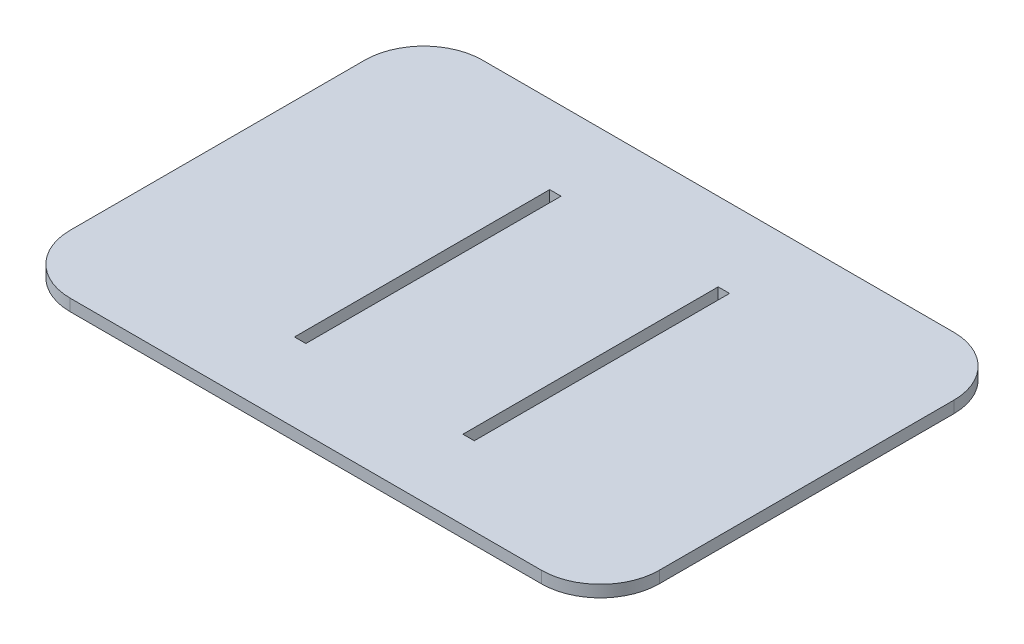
ISO-10303-21;
HEADER;
FILE_DESCRIPTION(('STEP AP214'),'2;1');
FILE_NAME('part.step','',(''),(''),'','','');
FILE_SCHEMA(('AUTOMOTIVE_DESIGN { 1 0 10303 214 1 1 1 1 }'));
ENDSEC;
DATA;
#1=APPLICATION_CONTEXT('core data for automotive mechanical design processes');
#2=APPLICATION_PROTOCOL_DEFINITION('international standard','automotive_design',2000,#1);
#3=PRODUCT_CONTEXT('',#1,'mechanical');
#4=PRODUCT('Part','Part','',(#3));
#5=PRODUCT_RELATED_PRODUCT_CATEGORY('part','',(#4));
#6=PRODUCT_DEFINITION_FORMATION('','',#4);
#7=PRODUCT_DEFINITION_CONTEXT('part definition',#1,'design');
#8=PRODUCT_DEFINITION('design','',#6,#7);
#9=PRODUCT_DEFINITION_SHAPE('','',#8);
#10=(LENGTH_UNIT() NAMED_UNIT(*) SI_UNIT(.MILLI.,.METRE.));
#11=(NAMED_UNIT(*) PLANE_ANGLE_UNIT() SI_UNIT($,.RADIAN.));
#12=(NAMED_UNIT(*) SI_UNIT($,.STERADIAN.) SOLID_ANGLE_UNIT());
#13=UNCERTAINTY_MEASURE_WITH_UNIT(LENGTH_MEASURE(1.E-05),#10,'distance_accuracy_value','');
#14=(GEOMETRIC_REPRESENTATION_CONTEXT(3) GLOBAL_UNCERTAINTY_ASSIGNED_CONTEXT((#13)) GLOBAL_UNIT_ASSIGNED_CONTEXT((#10,
#11,#12)) REPRESENTATION_CONTEXT('',''));
#15=CARTESIAN_POINT('',(0.,0.,0.));
#16=DIRECTION('',(0.,0.,1.));
#17=DIRECTION('',(1.,0.,0.));
#18=AXIS2_PLACEMENT_3D('',#15,#16,#17);
#19=CARTESIAN_POINT('',(-60.,3.,50.));
#20=DIRECTION('',(0.,1.,0.));
#21=DIRECTION('',(0.,0.,1.));
#22=AXIS2_PLACEMENT_3D('',#19,#20,#21);
#23=PLANE('',#22);
#24=CARTESIAN_POINT('',(-60.,3.,50.));
#25=DIRECTION('',(0.,1.,0.));
#26=DIRECTION('',(0.,0.,1.));
#27=AXIS2_PLACEMENT_3D('',#24,#25,#26);
#28=CIRCLE('',#27,15.);
#29=CARTESIAN_POINT('',(-75.,3.,49.9999999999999));
#30=VERTEX_POINT('',#29);
#31=CARTESIAN_POINT('',(-59.9999999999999,3.,65.));
#32=VERTEX_POINT('',#31);
#33=EDGE_CURVE('E213',#30,#32,#28,.T.);
#34=ORIENTED_EDGE('',*,*,#33,.T.);
#35=DIRECTION('',(1.,0.,0.));
#36=VECTOR('',#35,1.);
#37=CARTESIAN_POINT('',(-59.9999999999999,3.,65.));
#38=LINE('',#37,#36);
#39=CARTESIAN_POINT('',(59.9999999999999,3.,65.));
#40=VERTEX_POINT('',#39);
#41=EDGE_CURVE('E216',#32,#40,#38,.T.);
#42=ORIENTED_EDGE('',*,*,#41,.T.);
#43=CARTESIAN_POINT('',(60.,3.,50.));
#44=DIRECTION('',(0.,1.,0.));
#45=DIRECTION('',(0.,0.,1.));
#46=AXIS2_PLACEMENT_3D('',#43,#44,#45);
#47=CIRCLE('',#46,15.);
#48=CARTESIAN_POINT('',(75.,3.,49.9999999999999));
#49=VERTEX_POINT('',#48);
#50=EDGE_CURVE('E219',#40,#49,#47,.T.);
#51=ORIENTED_EDGE('',*,*,#50,.T.);
#52=DIRECTION('',(0.,0.,-1.));
#53=VECTOR('',#52,1.);
#54=CARTESIAN_POINT('',(75.,3.,49.9999999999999));
#55=LINE('',#54,#53);
#56=CARTESIAN_POINT('',(75.,3.,-25.));
#57=VERTEX_POINT('',#56);
#58=EDGE_CURVE('E221',#49,#57,#55,.T.);
#59=ORIENTED_EDGE('',*,*,#58,.T.);
#60=CARTESIAN_POINT('',(60.,3.,-25.));
#61=DIRECTION('',(0.,1.,0.));
#62=DIRECTION('',(0.,0.,1.));
#63=AXIS2_PLACEMENT_3D('',#60,#61,#62);
#64=CIRCLE('',#63,15.);
#65=CARTESIAN_POINT('',(60.,3.,-40.));
#66=VERTEX_POINT('',#65);
#67=EDGE_CURVE('E223',#57,#66,#64,.T.);
#68=ORIENTED_EDGE('',*,*,#67,.T.);
#69=DIRECTION('',(-1.,0.,0.));
#70=VECTOR('',#69,1.);
#71=CARTESIAN_POINT('',(-60.,3.,-40.));
#72=LINE('',#71,#70);
#73=CARTESIAN_POINT('',(-60.,3.,-40.));
#74=VERTEX_POINT('',#73);
#75=EDGE_CURVE('E225',#66,#74,#72,.T.);
#76=ORIENTED_EDGE('',*,*,#75,.T.);
#77=CARTESIAN_POINT('',(-60.,3.,-25.));
#78=DIRECTION('',(0.,1.,0.));
#79=DIRECTION('',(0.,0.,-1.));
#80=AXIS2_PLACEMENT_3D('',#77,#78,#79);
#81=CIRCLE('',#80,15.);
#82=CARTESIAN_POINT('',(-75.,3.,-25.));
#83=VERTEX_POINT('',#82);
#84=EDGE_CURVE('E227',#74,#83,#81,.T.);
#85=ORIENTED_EDGE('',*,*,#84,.T.);
#86=DIRECTION('',(0.,0.,1.));
#87=VECTOR('',#86,1.);
#88=CARTESIAN_POINT('',(-75.,3.,49.9999999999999));
#89=LINE('',#88,#87);
#90=EDGE_CURVE('E229',#83,#30,#89,.T.);
#91=ORIENTED_EDGE('',*,*,#90,.T.);
#92=EDGE_LOOP('',(#34,#42,#51,#59,#68,#76,#85,#91));
#93=FACE_BOUND('',#92,.T.);
#94=DIRECTION('',(0.,0.,-1.));
#95=VECTOR('',#94,1.);
#96=CARTESIAN_POINT('',(-20.,3.,-20.));
#97=LINE('',#96,#95);
#98=CARTESIAN_POINT('',(-20.,3.,45.));
#99=VERTEX_POINT('',#98);
#100=CARTESIAN_POINT('',(-20.,3.,-20.));
#101=VERTEX_POINT('',#100);
#102=EDGE_CURVE('E184',#99,#101,#97,.T.);
#103=ORIENTED_EDGE('',*,*,#102,.F.);
#104=DIRECTION('',(1.,0.,0.));
#105=VECTOR('',#104,1.);
#106=CARTESIAN_POINT('',(-22.9,3.,45.));
#107=LINE('',#106,#105);
#108=CARTESIAN_POINT('',(-22.9,3.,45.));
#109=VERTEX_POINT('',#108);
#110=EDGE_CURVE('E182',#109,#99,#107,.T.);
#111=ORIENTED_EDGE('',*,*,#110,.F.);
#112=DIRECTION('',(0.,0.,1.));
#113=VECTOR('',#112,1.);
#114=CARTESIAN_POINT('',(-22.9,3.,-20.));
#115=LINE('',#114,#113);
#116=CARTESIAN_POINT('',(-22.9,3.,-20.));
#117=VERTEX_POINT('',#116);
#118=EDGE_CURVE('E190',#117,#109,#115,.T.);
#119=ORIENTED_EDGE('',*,*,#118,.F.);
#120=DIRECTION('',(-1.,0.,0.));
#121=VECTOR('',#120,1.);
#122=CARTESIAN_POINT('',(-20.,3.,-20.));
#123=LINE('',#122,#121);
#124=EDGE_CURVE('E187',#101,#117,#123,.T.);
#125=ORIENTED_EDGE('',*,*,#124,.F.);
#126=EDGE_LOOP('',(#103,#111,#119,#125));
#127=FACE_BOUND('',#126,.T.);
#128=DIRECTION('',(-1.,0.,0.));
#129=VECTOR('',#128,1.);
#130=CARTESIAN_POINT('',(20.,3.,-20.));
#131=LINE('',#130,#129);
#132=CARTESIAN_POINT('',(22.9,3.,-20.));
#133=VERTEX_POINT('',#132);
#134=CARTESIAN_POINT('',(20.,3.,-20.));
#135=VERTEX_POINT('',#134);
#136=EDGE_CURVE('E154',#133,#135,#131,.T.);
#137=ORIENTED_EDGE('',*,*,#136,.F.);
#138=DIRECTION('',(0.,0.,-1.));
#139=VECTOR('',#138,1.);
#140=CARTESIAN_POINT('',(22.9,3.,-20.));
#141=LINE('',#140,#139);
#142=CARTESIAN_POINT('',(22.9,3.,45.));
#143=VERTEX_POINT('',#142);
#144=EDGE_CURVE('E146',#143,#133,#141,.T.);
#145=ORIENTED_EDGE('',*,*,#144,.F.);
#146=DIRECTION('',(1.,0.,0.));
#147=VECTOR('',#146,1.);
#148=CARTESIAN_POINT('',(22.9,3.,45.));
#149=LINE('',#148,#147);
#150=CARTESIAN_POINT('',(20.,3.,45.));
#151=VERTEX_POINT('',#150);
#152=EDGE_CURVE('E168',#151,#143,#149,.T.);
#153=ORIENTED_EDGE('',*,*,#152,.F.);
#154=DIRECTION('',(0.,0.,1.));
#155=VECTOR('',#154,1.);
#156=CARTESIAN_POINT('',(20.,3.,-20.));
#157=LINE('',#156,#155);
#158=EDGE_CURVE('E166',#135,#151,#157,.T.);
#159=ORIENTED_EDGE('',*,*,#158,.F.);
#160=EDGE_LOOP('',(#137,#145,#153,#159));
#161=FACE_BOUND('',#160,.T.);
#162=ADVANCED_FACE('F33',(#93,#127,#161),#23,.T.);
#163=CARTESIAN_POINT('',(-60.,0.,50.));
#164=DIRECTION('',(0.,1.,0.));
#165=DIRECTION('',(0.,0.,1.));
#166=AXIS2_PLACEMENT_3D('',#163,#164,#165);
#167=PLANE('',#166);
#168=DIRECTION('',(1.,0.,0.));
#169=VECTOR('',#168,1.);
#170=CARTESIAN_POINT('',(-22.9,0.,45.));
#171=LINE('',#170,#169);
#172=CARTESIAN_POINT('',(-22.9,0.,45.));
#173=VERTEX_POINT('',#172);
#174=CARTESIAN_POINT('',(-20.,0.,45.));
#175=VERTEX_POINT('',#174);
#176=EDGE_CURVE('E162',#173,#175,#171,.T.);
#177=ORIENTED_EDGE('',*,*,#176,.T.);
#178=DIRECTION('',(0.,0.,-1.));
#179=VECTOR('',#178,1.);
#180=CARTESIAN_POINT('',(-20.,0.,-20.));
#181=LINE('',#180,#179);
#182=CARTESIAN_POINT('',(-20.,0.,-20.));
#183=VERTEX_POINT('',#182);
#184=EDGE_CURVE('E195',#175,#183,#181,.T.);
#185=ORIENTED_EDGE('',*,*,#184,.T.);
#186=DIRECTION('',(-1.,0.,0.));
#187=VECTOR('',#186,1.);
#188=CARTESIAN_POINT('',(-20.,0.,-20.));
#189=LINE('',#188,#187);
#190=CARTESIAN_POINT('',(-22.9,0.,-20.));
#191=VERTEX_POINT('',#190);
#192=EDGE_CURVE('E198',#183,#191,#189,.T.);
#193=ORIENTED_EDGE('',*,*,#192,.T.);
#194=DIRECTION('',(0.,0.,1.));
#195=VECTOR('',#194,1.);
#196=CARTESIAN_POINT('',(-22.9,0.,-20.));
#197=LINE('',#196,#195);
#198=EDGE_CURVE('E185',#191,#173,#197,.T.);
#199=ORIENTED_EDGE('',*,*,#198,.T.);
#200=EDGE_LOOP('',(#177,#185,#193,#199));
#201=FACE_BOUND('',#200,.T.);
#202=CARTESIAN_POINT('',(-60.,0.,50.));
#203=DIRECTION('',(0.,1.,0.));
#204=DIRECTION('',(0.,0.,1.));
#205=AXIS2_PLACEMENT_3D('',#202,#203,#204);
#206=CIRCLE('',#205,15.);
#207=CARTESIAN_POINT('',(-75.,0.,49.9999999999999));
#208=VERTEX_POINT('',#207);
#209=CARTESIAN_POINT('',(-59.9999999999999,0.,65.));
#210=VERTEX_POINT('',#209);
#211=EDGE_CURVE('E212',#208,#210,#206,.T.);
#212=ORIENTED_EDGE('',*,*,#211,.F.);
#213=DIRECTION('',(0.,0.,1.));
#214=VECTOR('',#213,1.);
#215=CARTESIAN_POINT('',(-75.,0.,49.9999999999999));
#216=LINE('',#215,#214);
#217=CARTESIAN_POINT('',(-75.,0.,-25.));
#218=VERTEX_POINT('',#217);
#219=EDGE_CURVE('E217',#218,#208,#216,.T.);
#220=ORIENTED_EDGE('',*,*,#219,.F.);
#221=CARTESIAN_POINT('',(-60.,0.,-25.));
#222=DIRECTION('',(0.,1.,0.));
#223=DIRECTION('',(0.,0.,-1.));
#224=AXIS2_PLACEMENT_3D('',#221,#222,#223);
#225=CIRCLE('',#224,15.);
#226=CARTESIAN_POINT('',(-60.,0.,-40.));
#227=VERTEX_POINT('',#226);
#228=EDGE_CURVE('E244',#227,#218,#225,.T.);
#229=ORIENTED_EDGE('',*,*,#228,.F.);
#230=DIRECTION('',(-1.,0.,0.));
#231=VECTOR('',#230,1.);
#232=CARTESIAN_POINT('',(-60.,0.,-40.));
#233=LINE('',#232,#231);
#234=CARTESIAN_POINT('',(60.,0.,-40.));
#235=VERTEX_POINT('',#234);
#236=EDGE_CURVE('E242',#235,#227,#233,.T.);
#237=ORIENTED_EDGE('',*,*,#236,.F.);
#238=CARTESIAN_POINT('',(60.,0.,-25.));
#239=DIRECTION('',(0.,1.,0.));
#240=DIRECTION('',(0.,0.,1.));
#241=AXIS2_PLACEMENT_3D('',#238,#239,#240);
#242=CIRCLE('',#241,15.);
#243=CARTESIAN_POINT('',(75.,0.,-25.));
#244=VERTEX_POINT('',#243);
#245=EDGE_CURVE('E240',#244,#235,#242,.T.);
#246=ORIENTED_EDGE('',*,*,#245,.F.);
#247=DIRECTION('',(0.,0.,-1.));
#248=VECTOR('',#247,1.);
#249=CARTESIAN_POINT('',(75.,0.,49.9999999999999));
#250=LINE('',#249,#248);
#251=CARTESIAN_POINT('',(75.,0.,49.9999999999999));
#252=VERTEX_POINT('',#251);
#253=EDGE_CURVE('E238',#252,#244,#250,.T.);
#254=ORIENTED_EDGE('',*,*,#253,.F.);
#255=CARTESIAN_POINT('',(60.,0.,50.));
#256=DIRECTION('',(0.,1.,0.));
#257=DIRECTION('',(0.,0.,1.));
#258=AXIS2_PLACEMENT_3D('',#255,#256,#257);
#259=CIRCLE('',#258,15.);
#260=CARTESIAN_POINT('',(59.9999999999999,0.,65.));
#261=VERTEX_POINT('',#260);
#262=EDGE_CURVE('E236',#261,#252,#259,.T.);
#263=ORIENTED_EDGE('',*,*,#262,.F.);
#264=DIRECTION('',(1.,0.,0.));
#265=VECTOR('',#264,1.);
#266=CARTESIAN_POINT('',(-59.9999999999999,0.,65.));
#267=LINE('',#266,#265);
#268=EDGE_CURVE('E234',#210,#261,#267,.T.);
#269=ORIENTED_EDGE('',*,*,#268,.F.);
#270=EDGE_LOOP('',(#212,#220,#229,#237,#246,#254,#263,#269));
#271=FACE_BOUND('',#270,.T.);
#272=DIRECTION('',(0.,0.,-1.));
#273=VECTOR('',#272,1.);
#274=CARTESIAN_POINT('',(22.9,0.,-20.));
#275=LINE('',#274,#273);
#276=CARTESIAN_POINT('',(22.9,0.,45.));
#277=VERTEX_POINT('',#276);
#278=CARTESIAN_POINT('',(22.9,0.,-20.));
#279=VERTEX_POINT('',#278);
#280=EDGE_CURVE('E56',#277,#279,#275,.T.);
#281=ORIENTED_EDGE('',*,*,#280,.T.);
#282=DIRECTION('',(-1.,0.,0.));
#283=VECTOR('',#282,1.);
#284=CARTESIAN_POINT('',(20.,0.,-20.));
#285=LINE('',#284,#283);
#286=CARTESIAN_POINT('',(20.,0.,-20.));
#287=VERTEX_POINT('',#286);
#288=EDGE_CURVE('E161',#279,#287,#285,.T.);
#289=ORIENTED_EDGE('',*,*,#288,.T.);
#290=DIRECTION('',(0.,0.,1.));
#291=VECTOR('',#290,1.);
#292=CARTESIAN_POINT('',(20.,0.,-20.));
#293=LINE('',#292,#291);
#294=CARTESIAN_POINT('',(20.,0.,45.));
#295=VERTEX_POINT('',#294);
#296=EDGE_CURVE('E174',#287,#295,#293,.T.);
#297=ORIENTED_EDGE('',*,*,#296,.T.);
#298=DIRECTION('',(1.,0.,0.));
#299=VECTOR('',#298,1.);
#300=CARTESIAN_POINT('',(22.9,0.,45.));
#301=LINE('',#300,#299);
#302=EDGE_CURVE('E155',#295,#277,#301,.T.);
#303=ORIENTED_EDGE('',*,*,#302,.T.);
#304=EDGE_LOOP('',(#281,#289,#297,#303));
#305=FACE_BOUND('',#304,.T.);
#306=ADVANCED_FACE('F274',(#201,#271,#305),#167,.F.);
#307=CARTESIAN_POINT('',(-60.,3.,50.));
#308=DIRECTION('',(0.,-1.,0.));
#309=DIRECTION('',(0.,0.,-1.));
#310=AXIS2_PLACEMENT_3D('',#307,#308,#309);
#311=CYLINDRICAL_SURFACE('',#310,15.);
#312=ORIENTED_EDGE('',*,*,#211,.T.);
#313=DIRECTION('',(0.,-1.,0.));
#314=VECTOR('',#313,1.);
#315=CARTESIAN_POINT('',(-59.9999999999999,3.,65.));
#316=LINE('',#315,#314);
#317=EDGE_CURVE('E11',#32,#210,#316,.T.);
#318=ORIENTED_EDGE('',*,*,#317,.F.);
#319=ORIENTED_EDGE('',*,*,#33,.F.);
#320=DIRECTION('',(0.,-1.,0.));
#321=VECTOR('',#320,1.);
#322=CARTESIAN_POINT('',(-75.,3.,49.9999999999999));
#323=LINE('',#322,#321);
#324=EDGE_CURVE('E231',#30,#208,#323,.T.);
#325=ORIENTED_EDGE('',*,*,#324,.T.);
#326=EDGE_LOOP('',(#312,#318,#319,#325));
#327=FACE_BOUND('',#326,.T.);
#328=ADVANCED_FACE('F35',(#327),#311,.T.);
#329=CARTESIAN_POINT('',(-59.9999999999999,3.,65.));
#330=DIRECTION('',(0.,0.,-1.));
#331=DIRECTION('',(-1.,0.,0.));
#332=AXIS2_PLACEMENT_3D('',#329,#330,#331);
#333=PLANE('',#332);
#334=ORIENTED_EDGE('',*,*,#268,.T.);
#335=DIRECTION('',(0.,-1.,0.));
#336=VECTOR('',#335,1.);
#337=CARTESIAN_POINT('',(59.9999999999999,3.,65.));
#338=LINE('',#337,#336);
#339=EDGE_CURVE('E41',#40,#261,#338,.T.);
#340=ORIENTED_EDGE('',*,*,#339,.F.);
#341=ORIENTED_EDGE('',*,*,#41,.F.);
#342=ORIENTED_EDGE('',*,*,#317,.T.);
#343=EDGE_LOOP('',(#334,#340,#341,#342));
#344=FACE_BOUND('',#343,.T.);
#345=ADVANCED_FACE('F292',(#344),#333,.F.);
#346=CARTESIAN_POINT('',(60.,3.,50.));
#347=DIRECTION('',(0.,-1.,0.));
#348=DIRECTION('',(0.,0.,-1.));
#349=AXIS2_PLACEMENT_3D('',#346,#347,#348);
#350=CYLINDRICAL_SURFACE('',#349,15.);
#351=ORIENTED_EDGE('',*,*,#262,.T.);
#352=DIRECTION('',(0.,-1.,0.));
#353=VECTOR('',#352,1.);
#354=CARTESIAN_POINT('',(75.,3.,49.9999999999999));
#355=LINE('',#354,#353);
#356=EDGE_CURVE('E261',#49,#252,#355,.T.);
#357=ORIENTED_EDGE('',*,*,#356,.F.);
#358=ORIENTED_EDGE('',*,*,#50,.F.);
#359=ORIENTED_EDGE('',*,*,#339,.T.);
#360=EDGE_LOOP('',(#351,#357,#358,#359));
#361=FACE_BOUND('',#360,.T.);
#362=ADVANCED_FACE('F268',(#361),#350,.T.);
#363=CARTESIAN_POINT('',(75.,3.,49.9999999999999));
#364=DIRECTION('',(-1.,0.,0.));
#365=DIRECTION('',(0.,0.,1.));
#366=AXIS2_PLACEMENT_3D('',#363,#364,#365);
#367=PLANE('',#366);
#368=ORIENTED_EDGE('',*,*,#253,.T.);
#369=DIRECTION('',(0.,-1.,0.));
#370=VECTOR('',#369,1.);
#371=CARTESIAN_POINT('',(75.,3.,-25.));
#372=LINE('',#371,#370);
#373=EDGE_CURVE('E258',#57,#244,#372,.T.);
#374=ORIENTED_EDGE('',*,*,#373,.F.);
#375=ORIENTED_EDGE('',*,*,#58,.F.);
#376=ORIENTED_EDGE('',*,*,#356,.T.);
#377=EDGE_LOOP('',(#368,#374,#375,#376));
#378=FACE_BOUND('',#377,.T.);
#379=ADVANCED_FACE('F280',(#378),#367,.F.);
#380=CARTESIAN_POINT('',(60.,3.,-25.));
#381=DIRECTION('',(0.,-1.,0.));
#382=DIRECTION('',(0.,0.,-1.));
#383=AXIS2_PLACEMENT_3D('',#380,#381,#382);
#384=CYLINDRICAL_SURFACE('',#383,15.);
#385=ORIENTED_EDGE('',*,*,#245,.T.);
#386=DIRECTION('',(0.,-1.,0.));
#387=VECTOR('',#386,1.);
#388=CARTESIAN_POINT('',(60.,3.,-40.));
#389=LINE('',#388,#387);
#390=EDGE_CURVE('E255',#66,#235,#389,.T.);
#391=ORIENTED_EDGE('',*,*,#390,.F.);
#392=ORIENTED_EDGE('',*,*,#67,.F.);
#393=ORIENTED_EDGE('',*,*,#373,.T.);
#394=EDGE_LOOP('',(#385,#391,#392,#393));
#395=FACE_BOUND('',#394,.T.);
#396=ADVANCED_FACE('F284',(#395),#384,.T.);
#397=CARTESIAN_POINT('',(-60.,3.,-40.));
#398=DIRECTION('',(0.,0.,1.));
#399=DIRECTION('',(1.,0.,0.));
#400=AXIS2_PLACEMENT_3D('',#397,#398,#399);
#401=PLANE('',#400);
#402=ORIENTED_EDGE('',*,*,#236,.T.);
#403=DIRECTION('',(0.,-1.,0.));
#404=VECTOR('',#403,1.);
#405=CARTESIAN_POINT('',(-60.,3.,-40.));
#406=LINE('',#405,#404);
#407=EDGE_CURVE('E252',#74,#227,#406,.T.);
#408=ORIENTED_EDGE('',*,*,#407,.F.);
#409=ORIENTED_EDGE('',*,*,#75,.F.);
#410=ORIENTED_EDGE('',*,*,#390,.T.);
#411=EDGE_LOOP('',(#402,#408,#409,#410));
#412=FACE_BOUND('',#411,.T.);
#413=ADVANCED_FACE('F305',(#412),#401,.F.);
#414=CARTESIAN_POINT('',(-60.,3.,-25.));
#415=DIRECTION('',(0.,-1.,0.));
#416=DIRECTION('',(0.,0.,-1.));
#417=AXIS2_PLACEMENT_3D('',#414,#415,#416);
#418=CYLINDRICAL_SURFACE('',#417,15.);
#419=ORIENTED_EDGE('',*,*,#228,.T.);
#420=DIRECTION('',(0.,-1.,0.));
#421=VECTOR('',#420,1.);
#422=CARTESIAN_POINT('',(-75.,3.,-25.));
#423=LINE('',#422,#421);
#424=EDGE_CURVE('E249',#83,#218,#423,.T.);
#425=ORIENTED_EDGE('',*,*,#424,.F.);
#426=ORIENTED_EDGE('',*,*,#84,.F.);
#427=ORIENTED_EDGE('',*,*,#407,.T.);
#428=EDGE_LOOP('',(#419,#425,#426,#427));
#429=FACE_BOUND('',#428,.T.);
#430=ADVANCED_FACE('F303',(#429),#418,.T.);
#431=CARTESIAN_POINT('',(-75.,3.,49.9999999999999));
#432=DIRECTION('',(1.,0.,0.));
#433=DIRECTION('',(0.,0.,-1.));
#434=AXIS2_PLACEMENT_3D('',#431,#432,#433);
#435=PLANE('',#434);
#436=ORIENTED_EDGE('',*,*,#219,.T.);
#437=ORIENTED_EDGE('',*,*,#324,.F.);
#438=ORIENTED_EDGE('',*,*,#90,.F.);
#439=ORIENTED_EDGE('',*,*,#424,.T.);
#440=EDGE_LOOP('',(#436,#437,#438,#439));
#441=FACE_BOUND('',#440,.T.);
#442=ADVANCED_FACE('F298',(#441),#435,.F.);
#443=CARTESIAN_POINT('',(-22.9,3.,45.));
#444=DIRECTION('',(0.,0.,-1.));
#445=DIRECTION('',(-1.,0.,0.));
#446=AXIS2_PLACEMENT_3D('',#443,#444,#445);
#447=PLANE('',#446);
#448=ORIENTED_EDGE('',*,*,#176,.F.);
#449=DIRECTION('',(0.,-1.,0.));
#450=VECTOR('',#449,1.);
#451=CARTESIAN_POINT('',(-22.9,3.,45.));
#452=LINE('',#451,#450);
#453=EDGE_CURVE('E192',#109,#173,#452,.T.);
#454=ORIENTED_EDGE('',*,*,#453,.F.);
#455=ORIENTED_EDGE('',*,*,#110,.T.);
#456=DIRECTION('',(0.,-1.,0.));
#457=VECTOR('',#456,1.);
#458=CARTESIAN_POINT('',(-20.,3.,45.));
#459=LINE('',#458,#457);
#460=EDGE_CURVE('E209',#99,#175,#459,.T.);
#461=ORIENTED_EDGE('',*,*,#460,.T.);
#462=EDGE_LOOP('',(#448,#454,#455,#461));
#463=FACE_BOUND('',#462,.T.);
#464=ADVANCED_FACE('F322',(#463),#447,.T.);
#465=CARTESIAN_POINT('',(-20.,3.,-20.));
#466=DIRECTION('',(-1.,0.,0.));
#467=DIRECTION('',(0.,0.,1.));
#468=AXIS2_PLACEMENT_3D('',#465,#466,#467);
#469=PLANE('',#468);
#470=ORIENTED_EDGE('',*,*,#184,.F.);
#471=ORIENTED_EDGE('',*,*,#460,.F.);
#472=ORIENTED_EDGE('',*,*,#102,.T.);
#473=DIRECTION('',(0.,-1.,0.));
#474=VECTOR('',#473,1.);
#475=CARTESIAN_POINT('',(-20.,3.,-20.));
#476=LINE('',#475,#474);
#477=EDGE_CURVE('E207',#101,#183,#476,.T.);
#478=ORIENTED_EDGE('',*,*,#477,.T.);
#479=EDGE_LOOP('',(#470,#471,#472,#478));
#480=FACE_BOUND('',#479,.T.);
#481=ADVANCED_FACE('F329',(#480),#469,.T.);
#482=CARTESIAN_POINT('',(-20.,3.,-20.));
#483=DIRECTION('',(0.,0.,1.));
#484=DIRECTION('',(1.,0.,0.));
#485=AXIS2_PLACEMENT_3D('',#482,#483,#484);
#486=PLANE('',#485);
#487=ORIENTED_EDGE('',*,*,#192,.F.);
#488=ORIENTED_EDGE('',*,*,#477,.F.);
#489=ORIENTED_EDGE('',*,*,#124,.T.);
#490=DIRECTION('',(0.,-1.,0.));
#491=VECTOR('',#490,1.);
#492=CARTESIAN_POINT('',(-22.9,3.,-20.));
#493=LINE('',#492,#491);
#494=EDGE_CURVE('E205',#117,#191,#493,.T.);
#495=ORIENTED_EDGE('',*,*,#494,.T.);
#496=EDGE_LOOP('',(#487,#488,#489,#495));
#497=FACE_BOUND('',#496,.T.);
#498=ADVANCED_FACE('F334',(#497),#486,.T.);
#499=CARTESIAN_POINT('',(-22.9,3.,-20.));
#500=DIRECTION('',(1.,0.,0.));
#501=DIRECTION('',(0.,0.,-1.));
#502=AXIS2_PLACEMENT_3D('',#499,#500,#501);
#503=PLANE('',#502);
#504=ORIENTED_EDGE('',*,*,#198,.F.);
#505=ORIENTED_EDGE('',*,*,#494,.F.);
#506=ORIENTED_EDGE('',*,*,#118,.T.);
#507=ORIENTED_EDGE('',*,*,#453,.T.);
#508=EDGE_LOOP('',(#504,#505,#506,#507));
#509=FACE_BOUND('',#508,.T.);
#510=ADVANCED_FACE('F341',(#509),#503,.T.);
#511=CARTESIAN_POINT('',(22.9,3.,-20.));
#512=DIRECTION('',(-1.,0.,0.));
#513=DIRECTION('',(0.,0.,1.));
#514=AXIS2_PLACEMENT_3D('',#511,#512,#513);
#515=PLANE('',#514);
#516=ORIENTED_EDGE('',*,*,#280,.F.);
#517=DIRECTION('',(0.,-1.,0.));
#518=VECTOR('',#517,1.);
#519=CARTESIAN_POINT('',(22.9,3.,45.));
#520=LINE('',#519,#518);
#521=EDGE_CURVE('E150',#143,#277,#520,.T.);
#522=ORIENTED_EDGE('',*,*,#521,.F.);
#523=ORIENTED_EDGE('',*,*,#144,.T.);
#524=DIRECTION('',(0.,-1.,0.));
#525=VECTOR('',#524,1.);
#526=CARTESIAN_POINT('',(22.9,3.,-20.));
#527=LINE('',#526,#525);
#528=EDGE_CURVE('E149',#133,#279,#527,.T.);
#529=ORIENTED_EDGE('',*,*,#528,.T.);
#530=EDGE_LOOP('',(#516,#522,#523,#529));
#531=FACE_BOUND('',#530,.T.);
#532=ADVANCED_FACE('F148',(#531),#515,.T.);
#533=CARTESIAN_POINT('',(20.,3.,-20.));
#534=DIRECTION('',(0.,0.,1.));
#535=DIRECTION('',(1.,0.,0.));
#536=AXIS2_PLACEMENT_3D('',#533,#534,#535);
#537=PLANE('',#536);
#538=ORIENTED_EDGE('',*,*,#288,.F.);
#539=ORIENTED_EDGE('',*,*,#528,.F.);
#540=ORIENTED_EDGE('',*,*,#136,.T.);
#541=DIRECTION('',(0.,-1.,0.));
#542=VECTOR('',#541,1.);
#543=CARTESIAN_POINT('',(20.,3.,-20.));
#544=LINE('',#543,#542);
#545=EDGE_CURVE('E163',#135,#287,#544,.T.);
#546=ORIENTED_EDGE('',*,*,#545,.T.);
#547=EDGE_LOOP('',(#538,#539,#540,#546));
#548=FACE_BOUND('',#547,.T.);
#549=ADVANCED_FACE('F158',(#548),#537,.T.);
#550=CARTESIAN_POINT('',(20.,3.,-20.));
#551=DIRECTION('',(1.,0.,0.));
#552=DIRECTION('',(0.,0.,-1.));
#553=AXIS2_PLACEMENT_3D('',#550,#551,#552);
#554=PLANE('',#553);
#555=ORIENTED_EDGE('',*,*,#296,.F.);
#556=ORIENTED_EDGE('',*,*,#545,.F.);
#557=ORIENTED_EDGE('',*,*,#158,.T.);
#558=DIRECTION('',(0.,-1.,0.));
#559=VECTOR('',#558,1.);
#560=CARTESIAN_POINT('',(20.,3.,45.));
#561=LINE('',#560,#559);
#562=EDGE_CURVE('E48',#151,#295,#561,.T.);
#563=ORIENTED_EDGE('',*,*,#562,.T.);
#564=EDGE_LOOP('',(#555,#556,#557,#563));
#565=FACE_BOUND('',#564,.T.);
#566=ADVANCED_FACE('F359',(#565),#554,.T.);
#567=CARTESIAN_POINT('',(22.9,3.,45.));
#568=DIRECTION('',(0.,0.,-1.));
#569=DIRECTION('',(-1.,0.,0.));
#570=AXIS2_PLACEMENT_3D('',#567,#568,#569);
#571=PLANE('',#570);
#572=ORIENTED_EDGE('',*,*,#302,.F.);
#573=ORIENTED_EDGE('',*,*,#562,.F.);
#574=ORIENTED_EDGE('',*,*,#152,.T.);
#575=ORIENTED_EDGE('',*,*,#521,.T.);
#576=EDGE_LOOP('',(#572,#573,#574,#575));
#577=FACE_BOUND('',#576,.T.);
#578=ADVANCED_FACE('F362',(#577),#571,.T.);
#579=CLOSED_SHELL('',(#162,#306,#328,#345,#362,#379,#396,#413,#430,#442,#464,#481,#498,#510,
#532,#549,#566,#578));
#580=MANIFOLD_SOLID_BREP('B2',#579);
#581=ADVANCED_BREP_SHAPE_REPRESENTATION('',(#18,#580),#14);
#582=SHAPE_DEFINITION_REPRESENTATION(#9,#581);
ENDSEC;
END-ISO-10303-21;
